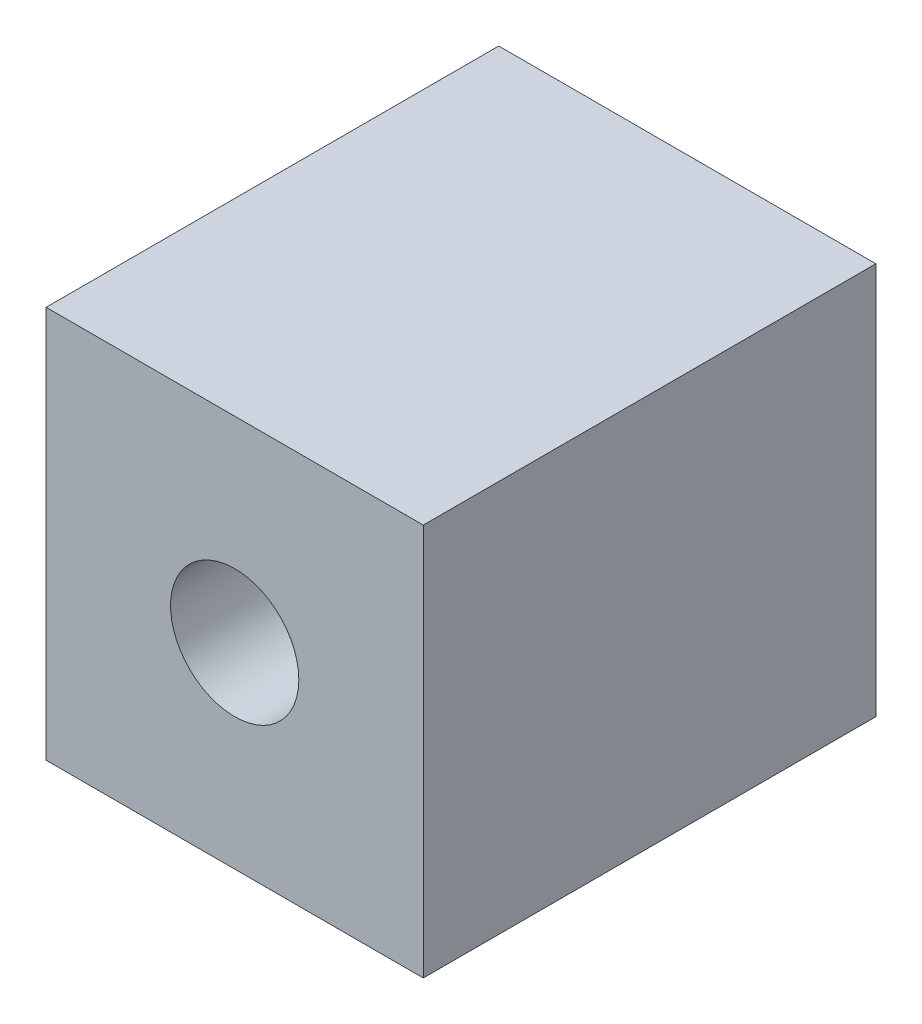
from build123d import *

# Parameters (mm, degrees)
ESQUISSE1_W                = 25
ESQUISSE1_H                = 26
EXTRUSION1_DEPTH           = 30
TROU_TARAUD_M10X1_51_D     = 8.5
TROU_TARAUD_M10X1_51_DEPTH = 21.5
TROU_TARAUD_M10X1_51_TIP   = 2.553657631


with BuildPart() as part:
    # Esquisse1 → Extrusion1 (new body)
    with BuildSketch(Plane.XY):
        with Locations((12.5, 13)):
            Rectangle(ESQUISSE1_W, ESQUISSE1_H)
    extrude(amount=EXTRUSION1_DEPTH)

    # Trou taraud_ M10x1.51
    with Locations(Plane.XY.offset(30)):
        with Locations((12.5, 13)):
            Hole(TROU_TARAUD_M10X1_51_D / 2, depth=TROU_TARAUD_M10X1_51_DEPTH)
            with Locations((0, 0, -(TROU_TARAUD_M10X1_51_DEPTH + TROU_TARAUD_M10X1_51_TIP / 2))):  # 118° drill point
                Cone(0, TROU_TARAUD_M10X1_51_D / 2, TROU_TARAUD_M10X1_51_TIP, mode=Mode.SUBTRACT)


solid = part.part
